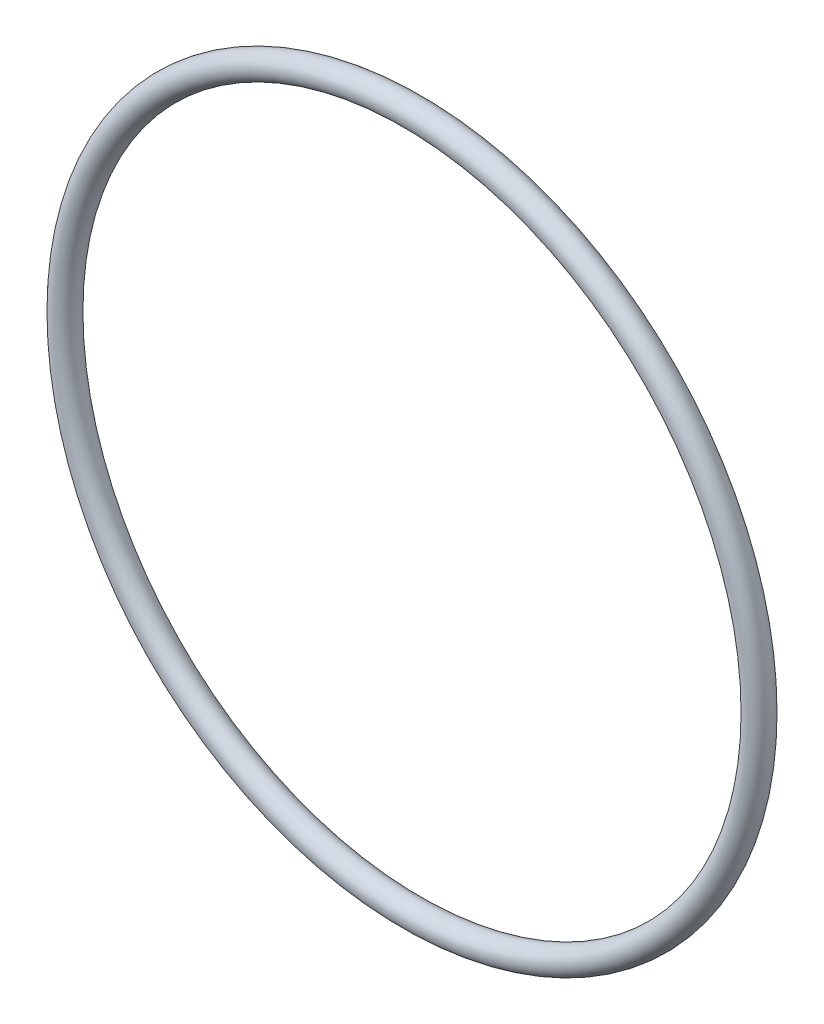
from build123d import *

# Parameters (mm, degrees)
SKETCH1_R = 3.4925


with BuildPart() as part:
    # Sketch1 → Revolve1 (revolve)
    with BuildSketch(Plane(origin=(0, 0, 0), x_dir=(0, -1, 0), z_dir=(1, 0, 0)), mode=Mode.PRIVATE) as revolve1_sk:
        with Locations((95.25, 0)):
            Circle(SKETCH1_R)
    revolve(revolve1_sk.sketch.rotate(Axis((0, 0, 3.4925), (0, 0, -1)), 270), axis=Axis((0, 0, 3.4925), (0, 0, -1)))


solid = part.part
